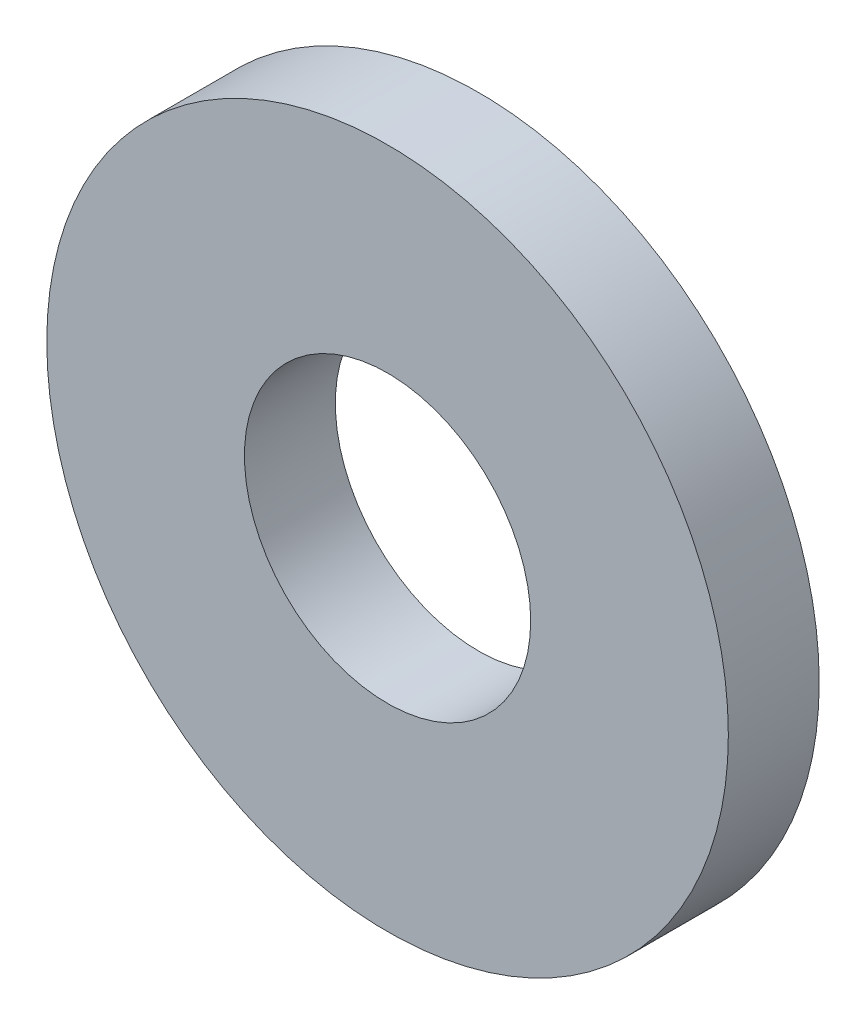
from build123d import *

# Parameters (mm, degrees)
SKIZZE1_R               = 150
SKIZZE1_R_2             = 63
LINEAR_AUSTRAGEN1_DEPTH = 40


with BuildPart() as part:
    # Skizze1 → Linear austragen1 (new body)
    with BuildSketch(Plane.XY):
        Circle(SKIZZE1_R)
        Circle(SKIZZE1_R_2, mode=Mode.SUBTRACT)
    extrude(amount=LINEAR_AUSTRAGEN1_DEPTH)


solid = part.part
